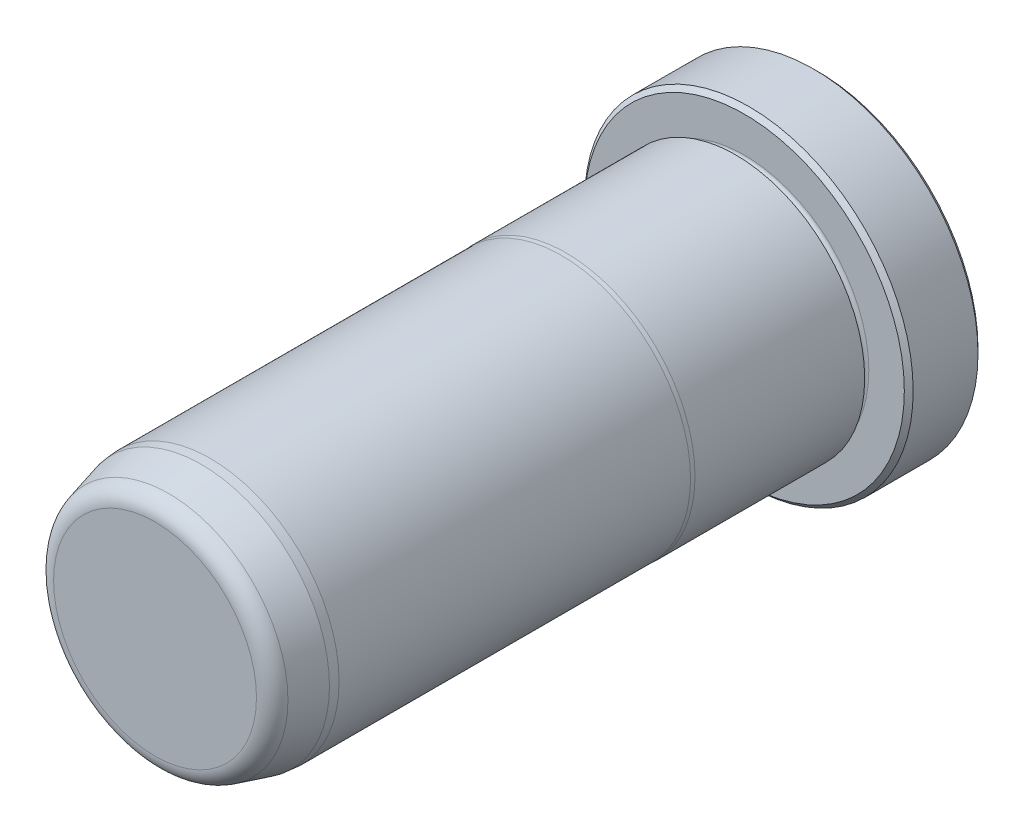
from build123d import *

# Parameters (mm, degrees)
FILLET6_R     = 1.5875
CHAMFER1_SIZE = 0.381


with BuildPart() as part:
    # Sketch1 → Revolve1 (revolve)
    with BuildSketch(Plane(origin=(0, 0, 0), x_dir=(0, 0, -1), z_dir=(1, 0, 0)), mode=Mode.PRIVATE) as revolve1_sk:
        with BuildLine():
            Line((0, 0), (0, 14.1605))
            Line((0, 14.1605), (-6.35, 14.1605))
            Line((-6.35, 14.1605), (-6.35, 10.7188))
            ThreePointArc((-6.35, 10.7188), (-6.731, 10.3378), (-7.112, 10.7188))
            Line((-7.112, 10.7188), (-7.112, 11.1252))
            Line((-7.112, 11.1252), (-21.734763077, 11.1252))
            Line((-21.734763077, 11.1252), (-22.098, 11.0998))
            Line((-22.098, 11.0998), (-52.3875, 11.0998))
            Line((-52.3875, 11.0998), (-53.1495, 11.033133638))
            Line((-53.1495, 11.033133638), (-57.15, 9.961202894))
            Line((-57.15, 9.961202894), (-57.15, 0))
            Line((-57.15, 0), (0, 0))
        make_face()
    revolve(revolve1_sk.sketch.rotate(Axis((0, 0, 0), (0, 0, -1)), 90), axis=Axis((0, 0, 0), (0, 0, -1)))

    # Fillet6
    fillet6_edges = [part.edges().sort_by_distance(p)[0] for p in [
        (-9.961202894, 0, 57.15),
    ]]
    fillet(fillet6_edges, radius=FILLET6_R)

    # Chamfer1
    chamfer1_edges = [part.edges().sort_by_distance(p)[0] for p in [
        (-14.1605, 0, 6.35),
        (-14.1605, 0, 0),
    ]]
    chamfer(chamfer1_edges, length=CHAMFER1_SIZE)


solid = part.part
